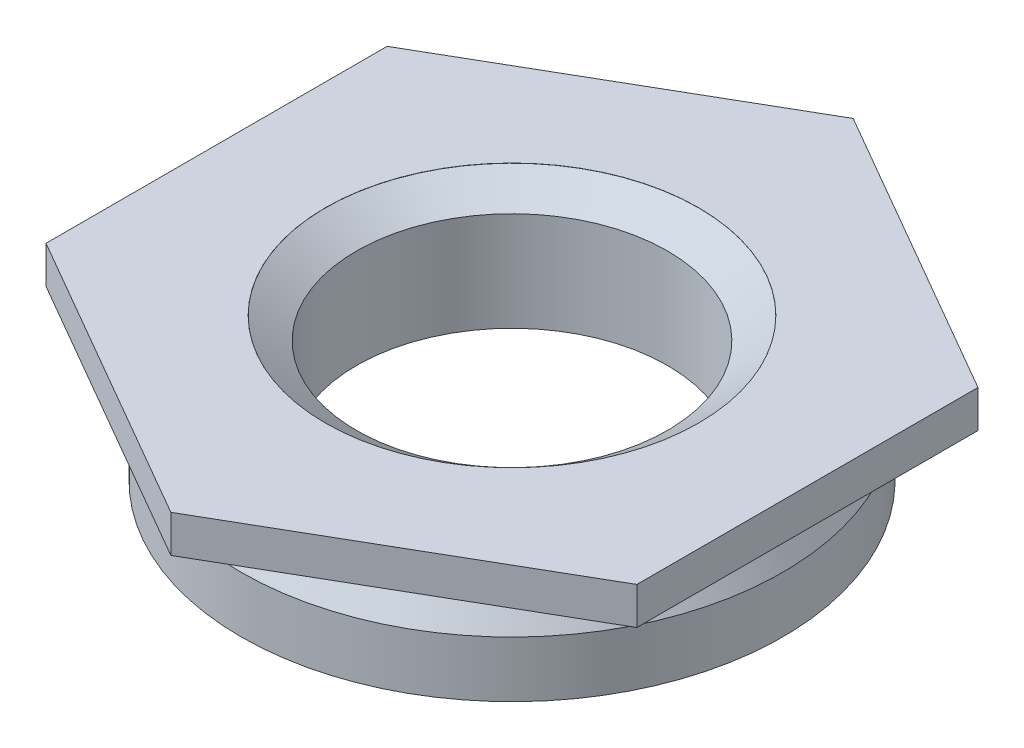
from build123d import *

# Parameters (mm, degrees)
HEXDIESKE_R  = 5.5105
HEXDIE_DEPTH = 0.6


with BuildPart() as part:
    # BodySke → Body (revolve)
    with BuildSketch(Plane.XY, mode=Mode.PRIVATE) as body_sk:
        Polygon((4.066324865, 0), (5.5095, 0), (5.5095, 0.6), (2.5, 0.6), (2.5, -1.7), (4.355, -1.7), (4.355, -0.8), (4.066324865, -0.3), align=None)
    revolve(body_sk.sketch.rotate(Axis((0, 0, 0), (0, 1, 0)), 90), axis=Axis((0, 0, 0), (0, 1, 0)))

    # EndChamferSke → EndChamfer (revolve, cut)
    with BuildSketch(Plane.XY, mode=Mode.PRIVATE) as endchamfer_sk:
        Polygon((3, -1.954), (3, -1.69746), (2.5, -1.347486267), (2.5, -1.954), align=None)
        Polygon((3, 0.59746), (2.5, 0.247486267), (2.5, 0.854), (3, 0.854), align=None)
    revolve(endchamfer_sk.sketch.rotate(Axis((0, -2.54, 0), (0, 1, 0)), 90), axis=Axis((0, -2.54, 0), (0, 1, 0)), mode=Mode.SUBTRACT)

    # HexDieSke → HexDie (cut)
    with BuildSketch(Plane(origin=(0, 0.6, 0), x_dir=(-1, 0, 0), z_dir=(0, 1, 0))):
        Circle(HEXDIESKE_R)
        Polygon((0, 5.484827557), (4.75, 2.742413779), (4.75, -2.742413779), (0, -5.484827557), (-4.75, -2.742413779), (-4.75, 2.742413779), align=None, mode=Mode.SUBTRACT)
    extrude(amount=-HEXDIE_DEPTH, mode=Mode.SUBTRACT)


solid = part.part
